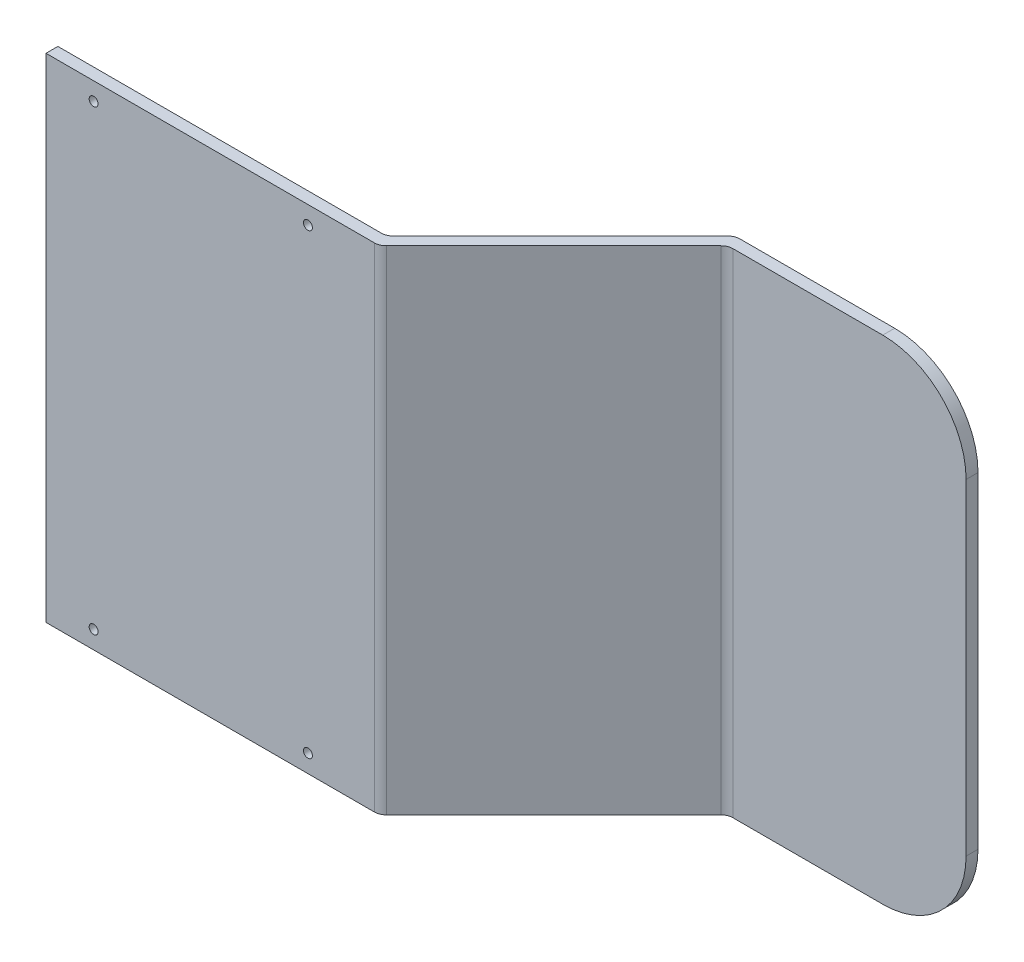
from build123d import *

# Parameters (mm, degrees)
EXTRUDE1_DEPTH = 525.78
FILLET1_R      = 12.7
FILLET2_R      = 88.9
SKETCH2_R      = 4.7625
EXTRUDE2_DEPTH = 975.04439815


with BuildPart() as part:
    # Sketch1 → Extrude1 (new body)
    with BuildSketch(Plane(origin=(0, 0, 0), x_dir=(1, 0, 0), z_dir=(0, 1, 0))):
        Polygon((0, 0), (355.6, 0), (541.528, 185.928), (795.528, 185.928), (795.528, 198.628), (536.267487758, 198.628), (350.339487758, 12.7), (0, 12.7), align=None)
    extrude(amount=-EXTRUDE1_DEPTH)

    # Fillet1
    fillet1_edges = [part.edges().sort_by_distance(p)[0] for p in [
        (350.339487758, -262.89, -12.7),
        (536.267487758, -262.89, -198.628),
        (541.528, -262.89, -185.928),
        (355.6, -262.89, 0),
    ]]
    fillet(fillet1_edges, radius=FILLET1_R)

    # Fillet2
    fillet2_edges = [part.edges().sort_by_distance(p)[0] for p in [
        (795.528, -525.78, -192.278),
        (795.528, 0, -192.278),
    ]]
    fillet(fillet2_edges, radius=FILLET2_R)

    # Sketch2 → Extrude2 (cut, through all)
    with BuildSketch(Plane.XY):
        with Locations((50.8, -19.05)):
            Circle(SKETCH2_R)
        with Locations((279.4, -19.05)):
            Circle(SKETCH2_R)
        with Locations(Location((279.4, -506.73, 0), (0, 0, 180))):
            Circle(SKETCH2_R)
        with Locations(Location((50.8, -506.73, 0), (0, 0, 180))):
            Circle(SKETCH2_R)
    extrude(amount=-EXTRUDE2_DEPTH, mode=Mode.SUBTRACT)


solid = part.part
